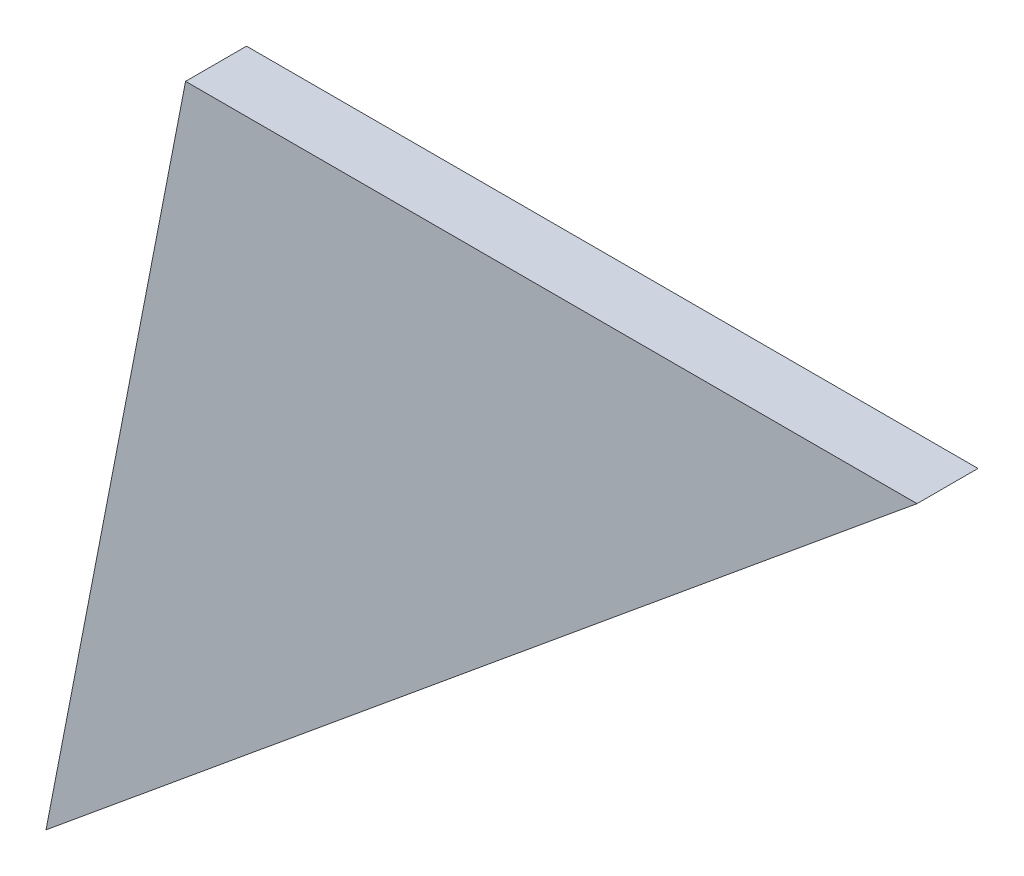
from build123d import *

# Parameters (mm, degrees)
EXTRUDE1_DEPTH = 6.35


with BuildPart() as part:
    # Sketch1 → Extrude1 (new body)
    with BuildSketch(Plane.XY):
        Polygon((0, 0), (76.2, 0), (-14.539645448, -74.799991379), align=None)
    extrude(amount=EXTRUDE1_DEPTH)


solid = part.part
